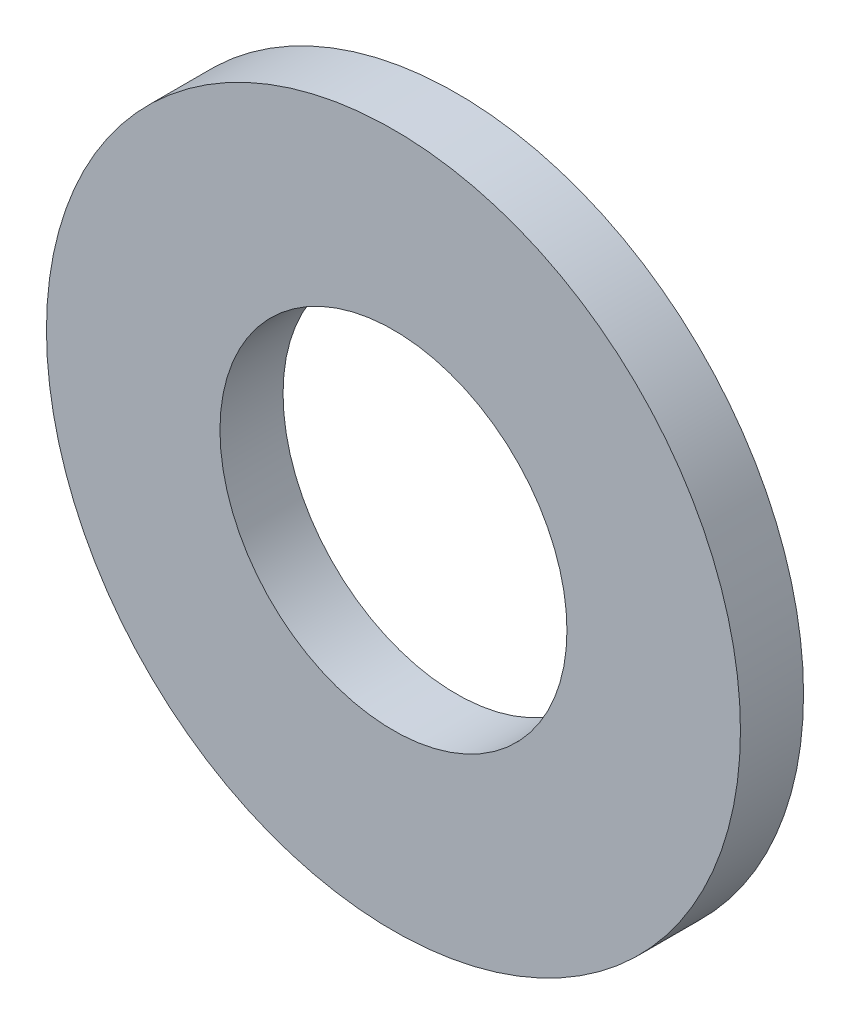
ISO-10303-21;
HEADER;
FILE_DESCRIPTION(('STEP AP214'),'2;1');
FILE_NAME('part.step','',(''),(''),'','','');
FILE_SCHEMA(('AUTOMOTIVE_DESIGN { 1 0 10303 214 1 1 1 1 }'));
ENDSEC;
DATA;
#1=APPLICATION_CONTEXT('core data for automotive mechanical design processes');
#2=APPLICATION_PROTOCOL_DEFINITION('international standard','automotive_design',2000,#1);
#3=PRODUCT_CONTEXT('',#1,'mechanical');
#4=PRODUCT('Part','Part','',(#3));
#5=PRODUCT_RELATED_PRODUCT_CATEGORY('part','',(#4));
#6=PRODUCT_DEFINITION_FORMATION('','',#4);
#7=PRODUCT_DEFINITION_CONTEXT('part definition',#1,'design');
#8=PRODUCT_DEFINITION('design','',#6,#7);
#9=PRODUCT_DEFINITION_SHAPE('','',#8);
#10=(LENGTH_UNIT() NAMED_UNIT(*) SI_UNIT(.MILLI.,.METRE.));
#11=(NAMED_UNIT(*) PLANE_ANGLE_UNIT() SI_UNIT($,.RADIAN.));
#12=(NAMED_UNIT(*) SI_UNIT($,.STERADIAN.) SOLID_ANGLE_UNIT());
#13=UNCERTAINTY_MEASURE_WITH_UNIT(LENGTH_MEASURE(1.E-05),#10,'distance_accuracy_value','');
#14=(GEOMETRIC_REPRESENTATION_CONTEXT(3) GLOBAL_UNCERTAINTY_ASSIGNED_CONTEXT((#13)) GLOBAL_UNIT_ASSIGNED_CONTEXT((#10,
#11,#12)) REPRESENTATION_CONTEXT('',''));
#15=CARTESIAN_POINT('',(0.,0.,0.));
#16=DIRECTION('',(0.,0.,1.));
#17=DIRECTION('',(1.,0.,0.));
#18=AXIS2_PLACEMENT_3D('',#15,#16,#17);
#19=CARTESIAN_POINT('',(0.,0.,0.));
#20=DIRECTION('',(0.,0.,1.));
#21=DIRECTION('',(1.,0.,0.));
#22=AXIS2_PLACEMENT_3D('',#19,#20,#21);
#23=CYLINDRICAL_SURFACE('',#22,5.5);
#24=CARTESIAN_POINT('',(0.,0.,2.));
#25=DIRECTION('',(0.,0.,1.));
#26=DIRECTION('',(1.,0.,0.));
#27=AXIS2_PLACEMENT_3D('',#24,#25,#26);
#28=CIRCLE('',#27,5.5);
#29=CARTESIAN_POINT('',(5.5,0.,2.));
#30=VERTEX_POINT('',#29);
#31=EDGE_CURVE('E10',#30,#30,#28,.T.);
#32=ORIENTED_EDGE('',*,*,#31,.T.);
#33=EDGE_LOOP('',(#32));
#34=FACE_BOUND('',#33,.T.);
#35=CARTESIAN_POINT('',(0.,0.,0.));
#36=DIRECTION('',(0.,0.,1.));
#37=DIRECTION('',(1.,0.,0.));
#38=AXIS2_PLACEMENT_3D('',#35,#36,#37);
#39=CIRCLE('',#38,5.5);
#40=CARTESIAN_POINT('',(5.5,0.,0.));
#41=VERTEX_POINT('',#40);
#42=EDGE_CURVE('E46',#41,#41,#39,.T.);
#43=ORIENTED_EDGE('',*,*,#42,.F.);
#44=EDGE_LOOP('',(#43));
#45=FACE_BOUND('',#44,.T.);
#46=ADVANCED_FACE('F32',(#34,#45),#23,.F.);
#47=CARTESIAN_POINT('',(5.5,0.,2.));
#48=DIRECTION('',(0.,0.,1.));
#49=DIRECTION('',(1.,0.,0.));
#50=AXIS2_PLACEMENT_3D('',#47,#48,#49);
#51=PLANE('',#50);
#52=CARTESIAN_POINT('',(0.,0.,2.));
#53=DIRECTION('',(0.,0.,1.));
#54=DIRECTION('',(1.,0.,0.));
#55=AXIS2_PLACEMENT_3D('',#52,#53,#54);
#56=CIRCLE('',#55,11.);
#57=CARTESIAN_POINT('',(11.,0.,2.));
#58=VERTEX_POINT('',#57);
#59=EDGE_CURVE('E38',#58,#58,#56,.T.);
#60=ORIENTED_EDGE('',*,*,#59,.T.);
#61=EDGE_LOOP('',(#60));
#62=FACE_BOUND('',#61,.T.);
#63=ORIENTED_EDGE('',*,*,#31,.F.);
#64=EDGE_LOOP('',(#63));
#65=FACE_BOUND('',#64,.T.);
#66=ADVANCED_FACE('F56',(#62,#65),#51,.T.);
#67=CARTESIAN_POINT('',(0.,0.,0.));
#68=DIRECTION('',(0.,0.,1.));
#69=DIRECTION('',(1.,0.,0.));
#70=AXIS2_PLACEMENT_3D('',#67,#68,#69);
#71=CYLINDRICAL_SURFACE('',#70,11.);
#72=CARTESIAN_POINT('',(0.,0.,0.));
#73=DIRECTION('',(0.,0.,1.));
#74=DIRECTION('',(1.,0.,0.));
#75=AXIS2_PLACEMENT_3D('',#72,#73,#74);
#76=CIRCLE('',#75,11.);
#77=CARTESIAN_POINT('',(11.,0.,0.));
#78=VERTEX_POINT('',#77);
#79=EDGE_CURVE('E42',#78,#78,#76,.T.);
#80=ORIENTED_EDGE('',*,*,#79,.T.);
#81=EDGE_LOOP('',(#80));
#82=FACE_BOUND('',#81,.T.);
#83=ORIENTED_EDGE('',*,*,#59,.F.);
#84=EDGE_LOOP('',(#83));
#85=FACE_BOUND('',#84,.T.);
#86=ADVANCED_FACE('F60',(#82,#85),#71,.T.);
#87=CARTESIAN_POINT('',(11.,0.,0.));
#88=DIRECTION('',(0.,0.,-1.));
#89=DIRECTION('',(-1.,0.,0.));
#90=AXIS2_PLACEMENT_3D('',#87,#88,#89);
#91=PLANE('',#90);
#92=ORIENTED_EDGE('',*,*,#42,.T.);
#93=EDGE_LOOP('',(#92));
#94=FACE_BOUND('',#93,.T.);
#95=ORIENTED_EDGE('',*,*,#79,.F.);
#96=EDGE_LOOP('',(#95));
#97=FACE_BOUND('',#96,.T.);
#98=ADVANCED_FACE('F52',(#94,#97),#91,.T.);
#99=CLOSED_SHELL('',(#46,#66,#86,#98));
#100=MANIFOLD_SOLID_BREP('B2',#99);
#101=ADVANCED_BREP_SHAPE_REPRESENTATION('',(#18,#100),#14);
#102=SHAPE_DEFINITION_REPRESENTATION(#9,#101);
ENDSEC;
END-ISO-10303-21;
